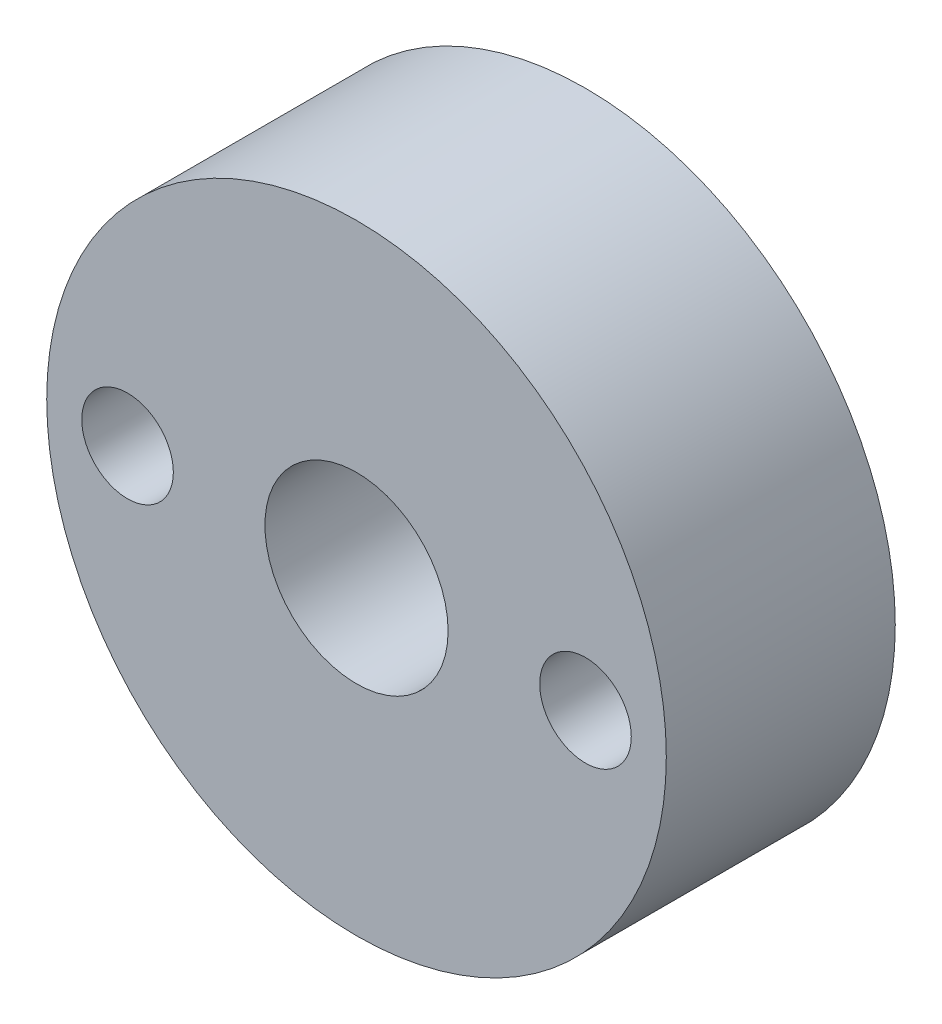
ISO-10303-21;
HEADER;
FILE_DESCRIPTION(('STEP AP214'),'2;1');
FILE_NAME('part.step','',(''),(''),'','','');
FILE_SCHEMA(('AUTOMOTIVE_DESIGN { 1 0 10303 214 1 1 1 1 }'));
ENDSEC;
DATA;
#1=APPLICATION_CONTEXT('core data for automotive mechanical design processes');
#2=APPLICATION_PROTOCOL_DEFINITION('international standard','automotive_design',2000,#1);
#3=PRODUCT_CONTEXT('',#1,'mechanical');
#4=PRODUCT('Part','Part','',(#3));
#5=PRODUCT_RELATED_PRODUCT_CATEGORY('part','',(#4));
#6=PRODUCT_DEFINITION_FORMATION('','',#4);
#7=PRODUCT_DEFINITION_CONTEXT('part definition',#1,'design');
#8=PRODUCT_DEFINITION('design','',#6,#7);
#9=PRODUCT_DEFINITION_SHAPE('','',#8);
#10=(LENGTH_UNIT() NAMED_UNIT(*) SI_UNIT(.MILLI.,.METRE.));
#11=(NAMED_UNIT(*) PLANE_ANGLE_UNIT() SI_UNIT($,.RADIAN.));
#12=(NAMED_UNIT(*) SI_UNIT($,.STERADIAN.) SOLID_ANGLE_UNIT());
#13=UNCERTAINTY_MEASURE_WITH_UNIT(LENGTH_MEASURE(1.E-05),#10,'distance_accuracy_value','');
#14=(GEOMETRIC_REPRESENTATION_CONTEXT(3) GLOBAL_UNCERTAINTY_ASSIGNED_CONTEXT((#13)) GLOBAL_UNIT_ASSIGNED_CONTEXT((#10,
#11,#12)) REPRESENTATION_CONTEXT('',''));
#15=CARTESIAN_POINT('',(0.,0.,0.));
#16=DIRECTION('',(0.,0.,1.));
#17=DIRECTION('',(1.,0.,0.));
#18=AXIS2_PLACEMENT_3D('',#15,#16,#17);
#19=CARTESIAN_POINT('',(0.,0.,5.));
#20=DIRECTION('',(0.,0.,-1.));
#21=DIRECTION('',(-1.,0.,0.));
#22=AXIS2_PLACEMENT_3D('',#19,#20,#21);
#23=CYLINDRICAL_SURFACE('',#22,6.765);
#24=CARTESIAN_POINT('',(0.,0.,5.));
#25=DIRECTION('',(0.,0.,1.));
#26=DIRECTION('',(1.,0.,0.));
#27=AXIS2_PLACEMENT_3D('',#24,#25,#26);
#28=CIRCLE('',#27,6.765);
#29=CARTESIAN_POINT('',(6.765,0.,5.));
#30=VERTEX_POINT('',#29);
#31=EDGE_CURVE('E10',#30,#30,#28,.T.);
#32=ORIENTED_EDGE('',*,*,#31,.F.);
#33=EDGE_LOOP('',(#32));
#34=FACE_BOUND('',#33,.T.);
#35=CARTESIAN_POINT('',(0.,0.,0.));
#36=DIRECTION('',(0.,0.,1.));
#37=DIRECTION('',(1.,0.,0.));
#38=AXIS2_PLACEMENT_3D('',#35,#36,#37);
#39=CIRCLE('',#38,6.765);
#40=CARTESIAN_POINT('',(6.765,0.,0.));
#41=VERTEX_POINT('',#40);
#42=EDGE_CURVE('E36',#41,#41,#39,.T.);
#43=ORIENTED_EDGE('',*,*,#42,.T.);
#44=EDGE_LOOP('',(#43));
#45=FACE_BOUND('',#44,.T.);
#46=ADVANCED_FACE('F33',(#34,#45),#23,.T.);
#47=CARTESIAN_POINT('',(0.,0.,5.));
#48=DIRECTION('',(0.,0.,1.));
#49=DIRECTION('',(1.,0.,0.));
#50=AXIS2_PLACEMENT_3D('',#47,#48,#49);
#51=PLANE('',#50);
#52=CARTESIAN_POINT('',(-5.,0.,5.));
#53=DIRECTION('',(0.,0.,1.));
#54=DIRECTION('',(1.,0.,0.));
#55=AXIS2_PLACEMENT_3D('',#52,#53,#54);
#56=CIRCLE('',#55,1.);
#57=CARTESIAN_POINT('',(-4.,0.,5.));
#58=VERTEX_POINT('',#57);
#59=EDGE_CURVE('E57',#58,#58,#56,.T.);
#60=ORIENTED_EDGE('',*,*,#59,.F.);
#61=EDGE_LOOP('',(#60));
#62=FACE_BOUND('',#61,.T.);
#63=CARTESIAN_POINT('',(5.,0.,5.));
#64=DIRECTION('',(0.,0.,1.));
#65=DIRECTION('',(1.,0.,0.));
#66=AXIS2_PLACEMENT_3D('',#63,#64,#65);
#67=CIRCLE('',#66,1.);
#68=CARTESIAN_POINT('',(6.,0.,5.));
#69=VERTEX_POINT('',#68);
#70=EDGE_CURVE('E51',#69,#69,#67,.T.);
#71=ORIENTED_EDGE('',*,*,#70,.F.);
#72=EDGE_LOOP('',(#71));
#73=FACE_BOUND('',#72,.T.);
#74=CARTESIAN_POINT('',(0.,0.,5.));
#75=DIRECTION('',(0.,0.,1.));
#76=DIRECTION('',(1.,0.,0.));
#77=AXIS2_PLACEMENT_3D('',#74,#75,#76);
#78=CIRCLE('',#77,2.);
#79=CARTESIAN_POINT('',(2.,0.,5.));
#80=VERTEX_POINT('',#79);
#81=EDGE_CURVE('E45',#80,#80,#78,.T.);
#82=ORIENTED_EDGE('',*,*,#81,.F.);
#83=EDGE_LOOP('',(#82));
#84=FACE_BOUND('',#83,.T.);
#85=ORIENTED_EDGE('',*,*,#31,.T.);
#86=EDGE_LOOP('',(#85));
#87=FACE_BOUND('',#86,.T.);
#88=ADVANCED_FACE('F73',(#62,#73,#84,#87),#51,.T.);
#89=CARTESIAN_POINT('',(0.,0.,0.));
#90=DIRECTION('',(0.,0.,1.));
#91=DIRECTION('',(1.,0.,0.));
#92=AXIS2_PLACEMENT_3D('',#89,#90,#91);
#93=PLANE('',#92);
#94=CARTESIAN_POINT('',(-5.,0.,0.));
#95=DIRECTION('',(0.,0.,1.));
#96=DIRECTION('',(1.,0.,0.));
#97=AXIS2_PLACEMENT_3D('',#94,#95,#96);
#98=CIRCLE('',#97,1.);
#99=CARTESIAN_POINT('',(-4.,0.,0.));
#100=VERTEX_POINT('',#99);
#101=EDGE_CURVE('E54',#100,#100,#98,.T.);
#102=ORIENTED_EDGE('',*,*,#101,.T.);
#103=EDGE_LOOP('',(#102));
#104=FACE_BOUND('',#103,.T.);
#105=CARTESIAN_POINT('',(5.,0.,0.));
#106=DIRECTION('',(0.,0.,1.));
#107=DIRECTION('',(1.,0.,0.));
#108=AXIS2_PLACEMENT_3D('',#105,#106,#107);
#109=CIRCLE('',#108,1.);
#110=CARTESIAN_POINT('',(6.,0.,0.));
#111=VERTEX_POINT('',#110);
#112=EDGE_CURVE('E48',#111,#111,#109,.T.);
#113=ORIENTED_EDGE('',*,*,#112,.T.);
#114=EDGE_LOOP('',(#113));
#115=FACE_BOUND('',#114,.T.);
#116=CARTESIAN_POINT('',(0.,0.,0.));
#117=DIRECTION('',(0.,0.,1.));
#118=DIRECTION('',(1.,0.,0.));
#119=AXIS2_PLACEMENT_3D('',#116,#117,#118);
#120=CIRCLE('',#119,2.);
#121=CARTESIAN_POINT('',(2.,0.,0.));
#122=VERTEX_POINT('',#121);
#123=EDGE_CURVE('E43',#122,#122,#120,.T.);
#124=ORIENTED_EDGE('',*,*,#123,.T.);
#125=EDGE_LOOP('',(#124));
#126=FACE_BOUND('',#125,.T.);
#127=ORIENTED_EDGE('',*,*,#42,.F.);
#128=EDGE_LOOP('',(#127));
#129=FACE_BOUND('',#128,.T.);
#130=ADVANCED_FACE('F63',(#104,#115,#126,#129),#93,.F.);
#131=CARTESIAN_POINT('',(0.,0.,0.));
#132=DIRECTION('',(0.,0.,1.));
#133=DIRECTION('',(1.,0.,0.));
#134=AXIS2_PLACEMENT_3D('',#131,#132,#133);
#135=CYLINDRICAL_SURFACE('',#134,2.);
#136=ORIENTED_EDGE('',*,*,#123,.F.);
#137=EDGE_LOOP('',(#136));
#138=FACE_BOUND('',#137,.T.);
#139=ORIENTED_EDGE('',*,*,#81,.T.);
#140=EDGE_LOOP('',(#139));
#141=FACE_BOUND('',#140,.T.);
#142=ADVANCED_FACE('F81',(#138,#141),#135,.F.);
#143=CARTESIAN_POINT('',(5.,0.,0.));
#144=DIRECTION('',(0.,0.,1.));
#145=DIRECTION('',(1.,0.,0.));
#146=AXIS2_PLACEMENT_3D('',#143,#144,#145);
#147=CYLINDRICAL_SURFACE('',#146,1.);
#148=ORIENTED_EDGE('',*,*,#112,.F.);
#149=EDGE_LOOP('',(#148));
#150=FACE_BOUND('',#149,.T.);
#151=ORIENTED_EDGE('',*,*,#70,.T.);
#152=EDGE_LOOP('',(#151));
#153=FACE_BOUND('',#152,.T.);
#154=ADVANCED_FACE('F69',(#150,#153),#147,.F.);
#155=CARTESIAN_POINT('',(-5.,0.,0.));
#156=DIRECTION('',(0.,0.,1.));
#157=DIRECTION('',(1.,0.,0.));
#158=AXIS2_PLACEMENT_3D('',#155,#156,#157);
#159=CYLINDRICAL_SURFACE('',#158,1.);
#160=ORIENTED_EDGE('',*,*,#101,.F.);
#161=EDGE_LOOP('',(#160));
#162=FACE_BOUND('',#161,.T.);
#163=ORIENTED_EDGE('',*,*,#59,.T.);
#164=EDGE_LOOP('',(#163));
#165=FACE_BOUND('',#164,.T.);
#166=ADVANCED_FACE('F66',(#162,#165),#159,.F.);
#167=CLOSED_SHELL('',(#46,#88,#130,#142,#154,#166));
#168=MANIFOLD_SOLID_BREP('B2',#167);
#169=ADVANCED_BREP_SHAPE_REPRESENTATION('',(#18,#168),#14);
#170=SHAPE_DEFINITION_REPRESENTATION(#9,#169);
ENDSEC;
END-ISO-10303-21;
